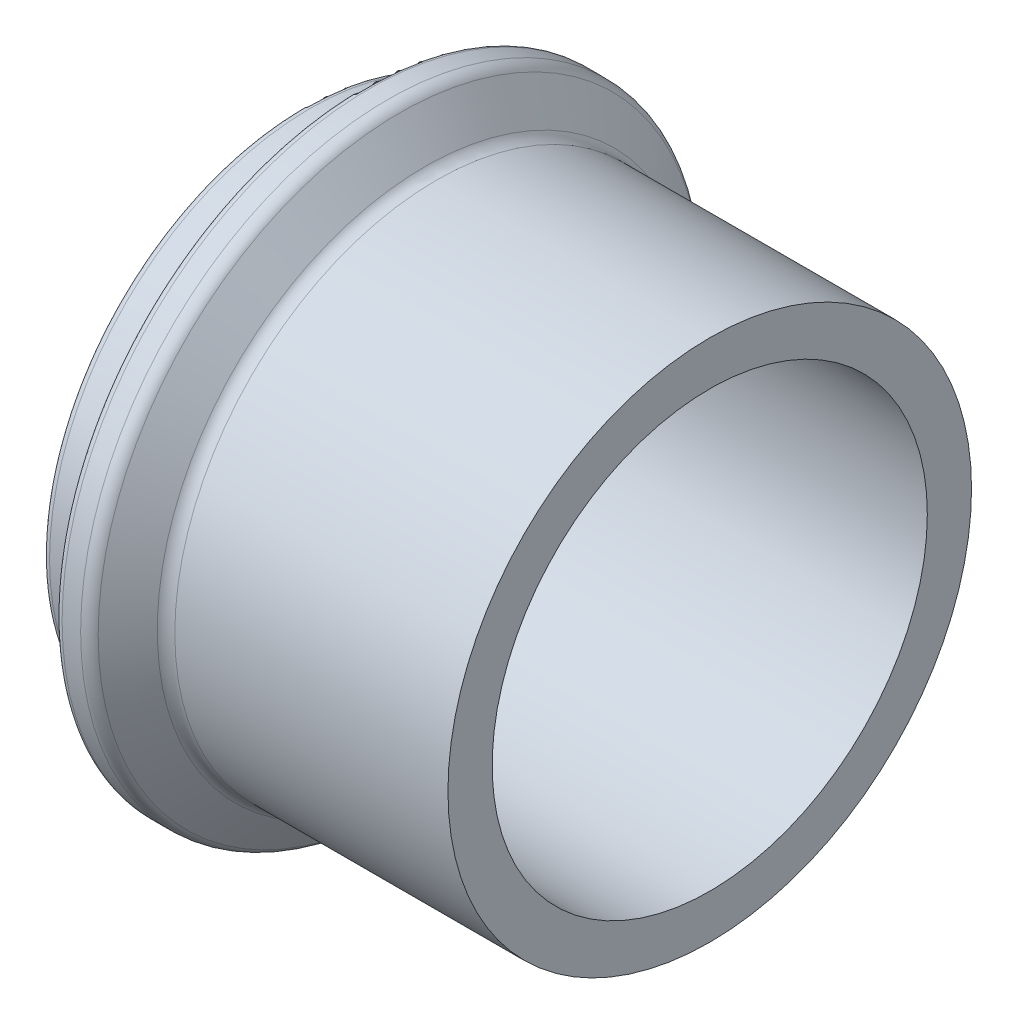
ISO-10303-21;
HEADER;
FILE_DESCRIPTION(('STEP AP214'),'2;1');
FILE_NAME('part.step','',(''),(''),'','','');
FILE_SCHEMA(('AUTOMOTIVE_DESIGN { 1 0 10303 214 1 1 1 1 }'));
ENDSEC;
DATA;
#1=APPLICATION_CONTEXT('core data for automotive mechanical design processes');
#2=APPLICATION_PROTOCOL_DEFINITION('international standard','automotive_design',2000,#1);
#3=PRODUCT_CONTEXT('',#1,'mechanical');
#4=PRODUCT('Part','Part','',(#3));
#5=PRODUCT_RELATED_PRODUCT_CATEGORY('part','',(#4));
#6=PRODUCT_DEFINITION_FORMATION('','',#4);
#7=PRODUCT_DEFINITION_CONTEXT('part definition',#1,'design');
#8=PRODUCT_DEFINITION('design','',#6,#7);
#9=PRODUCT_DEFINITION_SHAPE('','',#8);
#10=(LENGTH_UNIT() NAMED_UNIT(*) SI_UNIT(.MILLI.,.METRE.));
#11=(NAMED_UNIT(*) PLANE_ANGLE_UNIT() SI_UNIT($,.RADIAN.));
#12=(NAMED_UNIT(*) SI_UNIT($,.STERADIAN.) SOLID_ANGLE_UNIT());
#13=UNCERTAINTY_MEASURE_WITH_UNIT(LENGTH_MEASURE(1.E-05),#10,'distance_accuracy_value','');
#14=(GEOMETRIC_REPRESENTATION_CONTEXT(3) GLOBAL_UNCERTAINTY_ASSIGNED_CONTEXT((#13)) GLOBAL_UNIT_ASSIGNED_CONTEXT((#10,
#11,#12)) REPRESENTATION_CONTEXT('',''));
#15=CARTESIAN_POINT('',(0.,0.,0.));
#16=DIRECTION('',(0.,0.,1.));
#17=DIRECTION('',(1.,0.,0.));
#18=AXIS2_PLACEMENT_3D('',#15,#16,#17);
#19=CARTESIAN_POINT('',(0.,28.575,0.));
#20=DIRECTION('',(1.,0.,0.));
#21=DIRECTION('',(0.,0.,-1.));
#22=AXIS2_PLACEMENT_3D('',#19,#20,#21);
#23=PLANE('',#22);
#24=CARTESIAN_POINT('',(0.,0.,0.));
#25=DIRECTION('',(1.,0.,0.));
#26=DIRECTION('',(0.,0.,-1.));
#27=AXIS2_PLACEMENT_3D('',#24,#25,#26);
#28=CIRCLE('',#27,28.575);
#29=CARTESIAN_POINT('',(0.,0.,-28.575));
#30=VERTEX_POINT('',#29);
#31=EDGE_CURVE('E10',#30,#30,#28,.T.);
#32=ORIENTED_EDGE('',*,*,#31,.T.);
#33=EDGE_LOOP('',(#32));
#34=FACE_BOUND('',#33,.T.);
#35=CARTESIAN_POINT('',(0.,0.,0.));
#36=DIRECTION('',(1.,0.,0.));
#37=DIRECTION('',(0.,0.,-1.));
#38=AXIS2_PLACEMENT_3D('',#35,#36,#37);
#39=CIRCLE('',#38,23.749);
#40=CARTESIAN_POINT('',(0.,0.,-23.749));
#41=VERTEX_POINT('',#40);
#42=EDGE_CURVE('E74',#41,#41,#39,.T.);
#43=ORIENTED_EDGE('',*,*,#42,.F.);
#44=EDGE_LOOP('',(#43));
#45=FACE_BOUND('',#44,.T.);
#46=ADVANCED_FACE('F31',(#34,#45),#23,.T.);
#47=CARTESIAN_POINT('',(0.,0.,0.));
#48=DIRECTION('',(1.,0.,0.));
#49=DIRECTION('',(0.,0.,-1.));
#50=AXIS2_PLACEMENT_3D('',#47,#48,#49);
#51=CYLINDRICAL_SURFACE('',#50,28.575);
#52=CARTESIAN_POINT('',(-29.8106165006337,0.,0.));
#53=DIRECTION('',(1.,0.,0.));
#54=DIRECTION('',(0.,0.,-1.));
#55=AXIS2_PLACEMENT_3D('',#52,#53,#54);
#56=CIRCLE('',#55,28.575);
#57=CARTESIAN_POINT('',(-29.8106165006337,0.,-28.575));
#58=VERTEX_POINT('',#57);
#59=EDGE_CURVE('E37',#58,#58,#56,.T.);
#60=ORIENTED_EDGE('',*,*,#59,.T.);
#61=EDGE_LOOP('',(#60));
#62=FACE_BOUND('',#61,.T.);
#63=ORIENTED_EDGE('',*,*,#31,.F.);
#64=EDGE_LOOP('',(#63));
#65=FACE_BOUND('',#64,.T.);
#66=ADVANCED_FACE('F82',(#62,#65),#51,.T.);
#67=CARTESIAN_POINT('',(-29.8106165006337,0.,0.));
#68=DIRECTION('',(1.,0.,0.));
#69=DIRECTION('',(0.,0.,-1.));
#70=AXIS2_PLACEMENT_3D('',#67,#68,#69);
#71=TOROIDAL_SURFACE('',#70,30.1752,1.6002);
#72=CARTESIAN_POINT('',(-31.0885930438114,0.,0.));
#73=DIRECTION('',(1.,0.,0.));
#74=DIRECTION('',(0.,0.,-1.));
#75=AXIS2_PLACEMENT_3D('',#72,#73,#74);
#76=CIRCLE('',#75,29.2121755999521);
#77=CARTESIAN_POINT('',(-31.0885930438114,0.,-29.2121755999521));
#78=VERTEX_POINT('',#77);
#79=EDGE_CURVE('E41',#78,#78,#76,.T.);
#80=ORIENTED_EDGE('',*,*,#79,.T.);
#81=EDGE_LOOP('',(#80));
#82=FACE_BOUND('',#81,.T.);
#83=ORIENTED_EDGE('',*,*,#59,.F.);
#84=EDGE_LOOP('',(#83));
#85=FACE_BOUND('',#84,.T.);
#86=ADVANCED_FACE('F86',(#82,#85),#71,.F.);
#87=CARTESIAN_POINT('',(-31.0885930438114,0.,0.));
#88=DIRECTION('',(-1.,0.,0.));
#89=DIRECTION('',(0.,0.,1.));
#90=AXIS2_PLACEMENT_3D('',#87,#88,#89);
#91=CONICAL_SURFACE('',#90,29.2121755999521,0.925024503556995);
#92=CARTESIAN_POINT('',(-33.8606537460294,0.,0.));
#93=DIRECTION('',(1.,0.,0.));
#94=DIRECTION('',(0.,0.,-1.));
#95=AXIS2_PLACEMENT_3D('',#92,#93,#94);
#96=CIRCLE('',#95,32.8908244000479);
#97=CARTESIAN_POINT('',(-33.8606537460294,0.,-32.8908244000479));
#98=VERTEX_POINT('',#97);
#99=EDGE_CURVE('E45',#98,#98,#96,.T.);
#100=ORIENTED_EDGE('',*,*,#99,.T.);
#101=EDGE_LOOP('',(#100));
#102=FACE_BOUND('',#101,.T.);
#103=ORIENTED_EDGE('',*,*,#79,.F.);
#104=EDGE_LOOP('',(#103));
#105=FACE_BOUND('',#104,.T.);
#106=ADVANCED_FACE('F90',(#102,#105),#91,.T.);
#107=CARTESIAN_POINT('',(-35.1386302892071,0.,0.));
#108=DIRECTION('',(1.,0.,0.));
#109=DIRECTION('',(0.,0.,-1.));
#110=AXIS2_PLACEMENT_3D('',#107,#108,#109);
#111=TOROIDAL_SURFACE('',#110,31.9278,1.6002);
#112=CARTESIAN_POINT('',(-35.1386302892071,0.,0.));
#113=DIRECTION('',(1.,0.,0.));
#114=DIRECTION('',(0.,0.,-1.));
#115=AXIS2_PLACEMENT_3D('',#112,#113,#114);
#116=CIRCLE('',#115,33.528);
#117=CARTESIAN_POINT('',(-35.1386302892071,0.,-33.528));
#118=VERTEX_POINT('',#117);
#119=EDGE_CURVE('E50',#118,#118,#116,.T.);
#120=ORIENTED_EDGE('',*,*,#119,.T.);
#121=EDGE_LOOP('',(#120));
#122=FACE_BOUND('',#121,.T.);
#123=ORIENTED_EDGE('',*,*,#99,.F.);
#124=EDGE_LOOP('',(#123));
#125=FACE_BOUND('',#124,.T.);
#126=ADVANCED_FACE('F97',(#122,#125),#111,.T.);
#127=CARTESIAN_POINT('',(0.,0.,0.));
#128=DIRECTION('',(1.,0.,0.));
#129=DIRECTION('',(0.,0.,-1.));
#130=AXIS2_PLACEMENT_3D('',#127,#128,#129);
#131=CYLINDRICAL_SURFACE('',#130,33.528);
#132=CARTESIAN_POINT('',(-37.1602,0.,0.));
#133=DIRECTION('',(1.,0.,0.));
#134=DIRECTION('',(0.,0.,-1.));
#135=AXIS2_PLACEMENT_3D('',#132,#133,#134);
#136=CIRCLE('',#135,33.528);
#137=CARTESIAN_POINT('',(-37.1602,0.,-33.528));
#138=VERTEX_POINT('',#137);
#139=EDGE_CURVE('E53',#138,#138,#136,.T.);
#140=ORIENTED_EDGE('',*,*,#139,.T.);
#141=EDGE_LOOP('',(#140));
#142=FACE_BOUND('',#141,.T.);
#143=ORIENTED_EDGE('',*,*,#119,.F.);
#144=EDGE_LOOP('',(#143));
#145=FACE_BOUND('',#144,.T.);
#146=ADVANCED_FACE('F101',(#142,#145),#131,.T.);
#147=CARTESIAN_POINT('',(-37.1602,0.,0.));
#148=DIRECTION('',(1.,0.,0.));
#149=DIRECTION('',(0.,0.,-1.));
#150=AXIS2_PLACEMENT_3D('',#147,#148,#149);
#151=TOROIDAL_SURFACE('',#150,32.7152,0.812800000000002);
#152=CARTESIAN_POINT('',(-37.973,0.,0.));
#153=DIRECTION('',(1.,0.,0.));
#154=DIRECTION('',(0.,0.,-1.));
#155=AXIS2_PLACEMENT_3D('',#152,#153,#154);
#156=CIRCLE('',#155,32.7152);
#157=CARTESIAN_POINT('',(-37.973,0.,-32.7152));
#158=VERTEX_POINT('',#157);
#159=EDGE_CURVE('E56',#158,#158,#156,.T.);
#160=ORIENTED_EDGE('',*,*,#159,.T.);
#161=EDGE_LOOP('',(#160));
#162=FACE_BOUND('',#161,.T.);
#163=ORIENTED_EDGE('',*,*,#139,.F.);
#164=EDGE_LOOP('',(#163));
#165=FACE_BOUND('',#164,.T.);
#166=ADVANCED_FACE('F105',(#162,#165),#151,.T.);
#167=CARTESIAN_POINT('',(-37.973,29.2354,0.));
#168=DIRECTION('',(-1.,0.,0.));
#169=DIRECTION('',(0.,0.,1.));
#170=AXIS2_PLACEMENT_3D('',#167,#168,#169);
#171=PLANE('',#170);
#172=CARTESIAN_POINT('',(-37.973,0.,0.));
#173=DIRECTION('',(1.,0.,0.));
#174=DIRECTION('',(0.,0.,-1.));
#175=AXIS2_PLACEMENT_3D('',#172,#173,#174);
#176=CIRCLE('',#175,29.2354);
#177=CARTESIAN_POINT('',(-37.973,0.,-29.2354));
#178=VERTEX_POINT('',#177);
#179=EDGE_CURVE('E59',#178,#178,#176,.T.);
#180=ORIENTED_EDGE('',*,*,#179,.T.);
#181=EDGE_LOOP('',(#180));
#182=FACE_BOUND('',#181,.T.);
#183=ORIENTED_EDGE('',*,*,#159,.F.);
#184=EDGE_LOOP('',(#183));
#185=FACE_BOUND('',#184,.T.);
#186=ADVANCED_FACE('F109',(#182,#185),#171,.T.);
#187=CARTESIAN_POINT('',(-38.7858,0.,0.));
#188=DIRECTION('',(1.,0.,0.));
#189=DIRECTION('',(0.,0.,-1.));
#190=AXIS2_PLACEMENT_3D('',#187,#188,#189);
#191=TOROIDAL_SURFACE('',#190,29.2354,0.812799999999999);
#192=CARTESIAN_POINT('',(-38.7858,0.,0.));
#193=DIRECTION('',(1.,0.,0.));
#194=DIRECTION('',(0.,0.,-1.));
#195=AXIS2_PLACEMENT_3D('',#192,#193,#194);
#196=CIRCLE('',#195,28.4226);
#197=CARTESIAN_POINT('',(-38.7858,0.,-28.4226));
#198=VERTEX_POINT('',#197);
#199=EDGE_CURVE('E62',#198,#198,#196,.T.);
#200=ORIENTED_EDGE('',*,*,#199,.T.);
#201=EDGE_LOOP('',(#200));
#202=FACE_BOUND('',#201,.T.);
#203=ORIENTED_EDGE('',*,*,#179,.F.);
#204=EDGE_LOOP('',(#203));
#205=FACE_BOUND('',#204,.T.);
#206=ADVANCED_FACE('F113',(#202,#205),#191,.F.);
#207=CARTESIAN_POINT('',(0.,0.,0.));
#208=DIRECTION('',(1.,0.,0.));
#209=DIRECTION('',(0.,0.,-1.));
#210=AXIS2_PLACEMENT_3D('',#207,#208,#209);
#211=CYLINDRICAL_SURFACE('',#210,28.4226);
#212=CARTESIAN_POINT('',(-43.6372,0.,0.));
#213=DIRECTION('',(1.,0.,0.));
#214=DIRECTION('',(0.,0.,-1.));
#215=AXIS2_PLACEMENT_3D('',#212,#213,#214);
#216=CIRCLE('',#215,28.4226);
#217=CARTESIAN_POINT('',(-43.6372,0.,-28.4226));
#218=VERTEX_POINT('',#217);
#219=EDGE_CURVE('E65',#218,#218,#216,.T.);
#220=ORIENTED_EDGE('',*,*,#219,.T.);
#221=EDGE_LOOP('',(#220));
#222=FACE_BOUND('',#221,.T.);
#223=ORIENTED_EDGE('',*,*,#199,.F.);
#224=EDGE_LOOP('',(#223));
#225=FACE_BOUND('',#224,.T.);
#226=ADVANCED_FACE('F117',(#222,#225),#211,.T.);
#227=CARTESIAN_POINT('',(-43.6372,0.,0.));
#228=DIRECTION('',(1.,0.,0.));
#229=DIRECTION('',(0.,0.,-1.));
#230=AXIS2_PLACEMENT_3D('',#227,#228,#229);
#231=TOROIDAL_SURFACE('',#230,27.6098,0.812800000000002);
#232=CARTESIAN_POINT('',(-44.45,0.,0.));
#233=DIRECTION('',(1.,0.,0.));
#234=DIRECTION('',(0.,0.,-1.));
#235=AXIS2_PLACEMENT_3D('',#232,#233,#234);
#236=CIRCLE('',#235,27.6098);
#237=CARTESIAN_POINT('',(-44.45,0.,-27.6098));
#238=VERTEX_POINT('',#237);
#239=EDGE_CURVE('E68',#238,#238,#236,.T.);
#240=ORIENTED_EDGE('',*,*,#239,.T.);
#241=EDGE_LOOP('',(#240));
#242=FACE_BOUND('',#241,.T.);
#243=ORIENTED_EDGE('',*,*,#219,.F.);
#244=EDGE_LOOP('',(#243));
#245=FACE_BOUND('',#244,.T.);
#246=ADVANCED_FACE('F121',(#242,#245),#231,.T.);
#247=CARTESIAN_POINT('',(-44.45,23.749,0.));
#248=DIRECTION('',(-1.,0.,0.));
#249=DIRECTION('',(0.,0.,1.));
#250=AXIS2_PLACEMENT_3D('',#247,#248,#249);
#251=PLANE('',#250);
#252=CARTESIAN_POINT('',(-44.45,0.,0.));
#253=DIRECTION('',(1.,0.,0.));
#254=DIRECTION('',(0.,0.,-1.));
#255=AXIS2_PLACEMENT_3D('',#252,#253,#254);
#256=CIRCLE('',#255,23.749);
#257=CARTESIAN_POINT('',(-44.45,0.,-23.749));
#258=VERTEX_POINT('',#257);
#259=EDGE_CURVE('E71',#258,#258,#256,.T.);
#260=ORIENTED_EDGE('',*,*,#259,.T.);
#261=EDGE_LOOP('',(#260));
#262=FACE_BOUND('',#261,.T.);
#263=ORIENTED_EDGE('',*,*,#239,.F.);
#264=EDGE_LOOP('',(#263));
#265=FACE_BOUND('',#264,.T.);
#266=ADVANCED_FACE('F125',(#262,#265),#251,.T.);
#267=CARTESIAN_POINT('',(0.,0.,0.));
#268=DIRECTION('',(1.,0.,0.));
#269=DIRECTION('',(0.,0.,-1.));
#270=AXIS2_PLACEMENT_3D('',#267,#268,#269);
#271=CYLINDRICAL_SURFACE('',#270,23.749);
#272=ORIENTED_EDGE('',*,*,#42,.T.);
#273=EDGE_LOOP('',(#272));
#274=FACE_BOUND('',#273,.T.);
#275=ORIENTED_EDGE('',*,*,#259,.F.);
#276=EDGE_LOOP('',(#275));
#277=FACE_BOUND('',#276,.T.);
#278=ADVANCED_FACE('F78',(#274,#277),#271,.F.);
#279=CLOSED_SHELL('',(#46,#66,#86,#106,#126,#146,#166,#186,#206,#226,#246,#266,#278));
#280=MANIFOLD_SOLID_BREP('B2',#279);
#281=ADVANCED_BREP_SHAPE_REPRESENTATION('',(#18,#280),#14);
#282=SHAPE_DEFINITION_REPRESENTATION(#9,#281);
ENDSEC;
END-ISO-10303-21;
